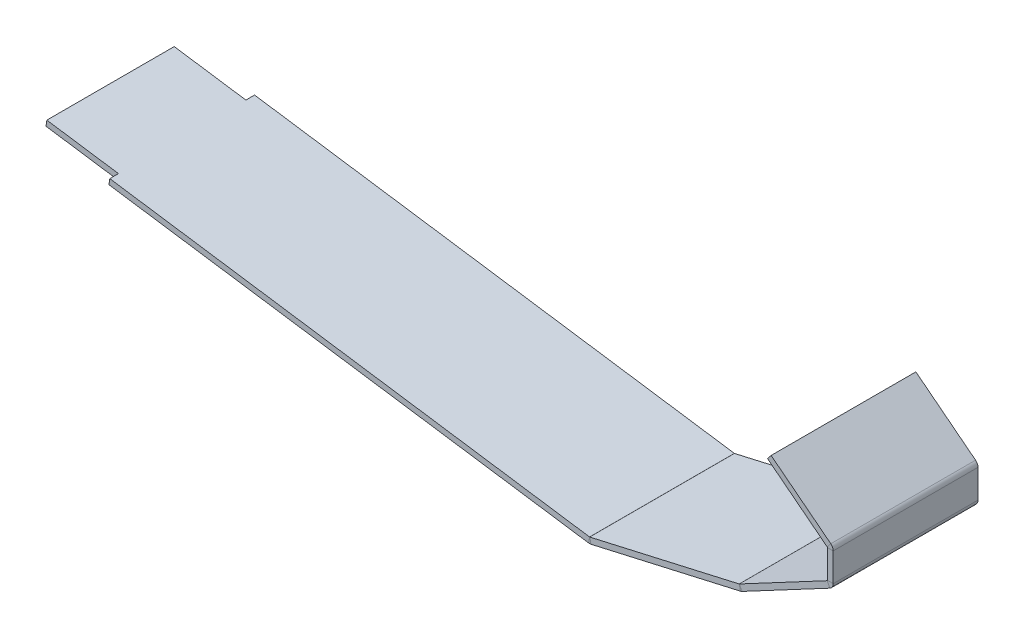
ISO-10303-21;
HEADER;
FILE_DESCRIPTION(('STEP AP214'),'2;1');
FILE_NAME('part.step','',(''),(''),'','','');
FILE_SCHEMA(('AUTOMOTIVE_DESIGN { 1 0 10303 214 1 1 1 1 }'));
ENDSEC;
DATA;
#1=APPLICATION_CONTEXT('core data for automotive mechanical design processes');
#2=APPLICATION_PROTOCOL_DEFINITION('international standard','automotive_design',2000,#1);
#3=PRODUCT_CONTEXT('',#1,'mechanical');
#4=PRODUCT('Part','Part','',(#3));
#5=PRODUCT_RELATED_PRODUCT_CATEGORY('part','',(#4));
#6=PRODUCT_DEFINITION_FORMATION('','',#4);
#7=PRODUCT_DEFINITION_CONTEXT('part definition',#1,'design');
#8=PRODUCT_DEFINITION('design','',#6,#7);
#9=PRODUCT_DEFINITION_SHAPE('','',#8);
#10=(LENGTH_UNIT() NAMED_UNIT(*) SI_UNIT(.MILLI.,.METRE.));
#11=(NAMED_UNIT(*) PLANE_ANGLE_UNIT() SI_UNIT($,.RADIAN.));
#12=(NAMED_UNIT(*) SI_UNIT($,.STERADIAN.) SOLID_ANGLE_UNIT());
#13=UNCERTAINTY_MEASURE_WITH_UNIT(LENGTH_MEASURE(1.E-05),#10,'distance_accuracy_value','');
#14=(GEOMETRIC_REPRESENTATION_CONTEXT(3) GLOBAL_UNCERTAINTY_ASSIGNED_CONTEXT((#13)) GLOBAL_UNIT_ASSIGNED_CONTEXT((#10,
#11,#12)) REPRESENTATION_CONTEXT('',''));
#15=CARTESIAN_POINT('',(0.,0.,0.));
#16=DIRECTION('',(0.,0.,1.));
#17=DIRECTION('',(1.,0.,0.));
#18=AXIS2_PLACEMENT_3D('',#15,#16,#17);
#19=CARTESIAN_POINT('',(-0.283103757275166,40.2211848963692,200.));
#20=DIRECTION('',(0.,0.,1.));
#21=DIRECTION('',(1.,0.,0.));
#22=AXIS2_PLACEMENT_3D('',#19,#20,#21);
#23=PLANE('',#22);
#24=DIRECTION('',(0.615661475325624,0.788010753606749,0.));
#25=VECTOR('',#24,1.);
#26=CARTESIAN_POINT('',(-0.283103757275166,40.2211848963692,200.));
#27=LINE('',#26,#25);
#28=CARTESIAN_POINT('',(-0.283103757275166,40.2211848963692,200.));
#29=VERTEX_POINT('',#28);
#30=CARTESIAN_POINT('',(4.64218804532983,46.5252709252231,200.));
#31=VERTEX_POINT('',#30);
#32=EDGE_CURVE('E257',#29,#31,#27,.T.);
#33=ORIENTED_EDGE('',*,*,#32,.F.);
#34=CARTESIAN_POINT('',(-0.736600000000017,39.6407361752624,200.));
#35=DIRECTION('',(0.,0.,1.));
#36=DIRECTION('',(1.,0.,0.));
#37=AXIS2_PLACEMENT_3D('',#34,#35,#36);
#38=CIRCLE('',#37,0.7366);
#39=CARTESIAN_POINT('',(0.,39.6407361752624,200.));
#40=VERTEX_POINT('',#39);
#41=EDGE_CURVE('E320',#29,#40,#38,.F.);
#42=ORIENTED_EDGE('',*,*,#41,.T.);
#43=DIRECTION('',(-1.,0.,0.));
#44=VECTOR('',#43,1.);
#45=CARTESIAN_POINT('',(8.,39.6407361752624,200.));
#46=LINE('',#45,#44);
#47=CARTESIAN_POINT('',(8.,39.6407361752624,200.));
#48=VERTEX_POINT('',#47);
#49=EDGE_CURVE('E255',#48,#40,#46,.T.);
#50=ORIENTED_EDGE('',*,*,#49,.F.);
#51=CARTESIAN_POINT('',(-0.736600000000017,39.6407361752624,200.));
#52=DIRECTION('',(0.,0.,1.));
#53=DIRECTION('',(1.,0.,0.));
#54=AXIS2_PLACEMENT_3D('',#51,#52,#53);
#55=CIRCLE('',#54,8.7366);
#56=EDGE_CURVE('E308',#31,#48,#55,.F.);
#57=ORIENTED_EDGE('',*,*,#56,.F.);
#58=EDGE_LOOP('',(#33,#42,#50,#57));
#59=FACE_BOUND('',#58,.T.);
#60=ADVANCED_FACE('F41',(#59),#23,.T.);
#61=CARTESIAN_POINT('',(8.,39.6407361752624,200.));
#62=DIRECTION('',(0.,0.,1.));
#63=DIRECTION('',(1.,0.,0.));
#64=AXIS2_PLACEMENT_3D('',#61,#62,#63);
#65=PLANE('',#64);
#66=DIRECTION('',(0.788010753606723,-0.615661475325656,0.));
#67=VECTOR('',#66,1.);
#68=CARTESIAN_POINT('',(-82.741129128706,104.644454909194,200.));
#69=LINE('',#68,#67);
#70=CARTESIAN_POINT('',(-82.741129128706,104.644454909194,200.));
#71=VERTEX_POINT('',#70);
#72=EDGE_CURVE('E317',#71,#29,#69,.T.);
#73=ORIENTED_EDGE('',*,*,#72,.T.);
#74=ORIENTED_EDGE('',*,*,#32,.T.);
#75=DIRECTION('',(0.788010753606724,-0.615661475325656,0.));
#76=VECTOR('',#75,1.);
#77=CARTESIAN_POINT('',(-77.8158373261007,110.948540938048,200.));
#78=LINE('',#77,#76);
#79=CARTESIAN_POINT('',(-77.8158373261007,110.948540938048,200.));
#80=VERTEX_POINT('',#79);
#81=EDGE_CURVE('E311',#80,#31,#78,.T.);
#82=ORIENTED_EDGE('',*,*,#81,.F.);
#83=DIRECTION('',(0.615661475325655,0.788010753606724,0.));
#84=VECTOR('',#83,1.);
#85=CARTESIAN_POINT('',(-82.741129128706,104.644454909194,200.));
#86=LINE('',#85,#84);
#87=EDGE_CURVE('E314',#71,#80,#86,.T.);
#88=ORIENTED_EDGE('',*,*,#87,.F.);
#89=EDGE_LOOP('',(#73,#74,#82,#88));
#90=FACE_BOUND('',#89,.T.);
#91=ADVANCED_FACE('F536',(#90),#65,.T.);
#92=CARTESIAN_POINT('',(0.,39.6407361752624,0.));
#93=DIRECTION('',(0.,0.,-1.));
#94=DIRECTION('',(-1.,0.,0.));
#95=AXIS2_PLACEMENT_3D('',#92,#93,#94);
#96=PLANE('',#95);
#97=DIRECTION('',(1.,0.,0.));
#98=VECTOR('',#97,1.);
#99=CARTESIAN_POINT('',(0.,39.6407361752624,0.));
#100=LINE('',#99,#98);
#101=CARTESIAN_POINT('',(0.,39.6407361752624,0.));
#102=VERTEX_POINT('',#101);
#103=CARTESIAN_POINT('',(8.,39.6407361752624,0.));
#104=VERTEX_POINT('',#103);
#105=EDGE_CURVE('E253',#102,#104,#100,.T.);
#106=ORIENTED_EDGE('',*,*,#105,.F.);
#107=CARTESIAN_POINT('',(-0.736600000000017,39.6407361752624,0.));
#108=DIRECTION('',(0.,0.,1.));
#109=DIRECTION('',(1.,0.,0.));
#110=AXIS2_PLACEMENT_3D('',#107,#108,#109);
#111=CIRCLE('',#110,0.7366);
#112=CARTESIAN_POINT('',(-0.283103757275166,40.2211848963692,0.));
#113=VERTEX_POINT('',#112);
#114=EDGE_CURVE('E374',#113,#102,#111,.F.);
#115=ORIENTED_EDGE('',*,*,#114,.F.);
#116=DIRECTION('',(-0.615661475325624,-0.788010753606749,0.));
#117=VECTOR('',#116,1.);
#118=CARTESIAN_POINT('',(4.64218804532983,46.5252709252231,0.));
#119=LINE('',#118,#117);
#120=CARTESIAN_POINT('',(4.64218804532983,46.5252709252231,0.));
#121=VERTEX_POINT('',#120);
#122=EDGE_CURVE('E251',#121,#113,#119,.T.);
#123=ORIENTED_EDGE('',*,*,#122,.F.);
#124=CARTESIAN_POINT('',(-0.736600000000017,39.6407361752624,0.));
#125=DIRECTION('',(0.,0.,1.));
#126=DIRECTION('',(1.,0.,0.));
#127=AXIS2_PLACEMENT_3D('',#124,#125,#126);
#128=CIRCLE('',#127,8.7366);
#129=EDGE_CURVE('E362',#121,#104,#128,.F.);
#130=ORIENTED_EDGE('',*,*,#129,.T.);
#131=EDGE_LOOP('',(#106,#115,#123,#130));
#132=FACE_BOUND('',#131,.T.);
#133=ADVANCED_FACE('F569',(#132),#96,.T.);
#134=CARTESIAN_POINT('',(4.64218804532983,46.5252709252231,0.));
#135=DIRECTION('',(0.,0.,-1.));
#136=DIRECTION('',(-1.,0.,0.));
#137=AXIS2_PLACEMENT_3D('',#134,#135,#136);
#138=PLANE('',#137);
#139=DIRECTION('',(0.,-1.,0.));
#140=VECTOR('',#139,1.);
#141=CARTESIAN_POINT('',(0.,40.,0.));
#142=LINE('',#141,#140);
#143=CARTESIAN_POINT('',(0.,0.442418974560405,0.));
#144=VERTEX_POINT('',#143);
#145=EDGE_CURVE('E377',#102,#144,#142,.T.);
#146=ORIENTED_EDGE('',*,*,#145,.F.);
#147=ORIENTED_EDGE('',*,*,#105,.T.);
#148=DIRECTION('',(0.,-1.,0.));
#149=VECTOR('',#148,1.);
#150=CARTESIAN_POINT('',(8.,40.,0.));
#151=LINE('',#150,#149);
#152=CARTESIAN_POINT('',(8.,0.442418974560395,0.));
#153=VERTEX_POINT('',#152);
#154=EDGE_CURVE('E359',#104,#153,#151,.T.);
#155=ORIENTED_EDGE('',*,*,#154,.T.);
#156=DIRECTION('',(-1.,0.,0.));
#157=VECTOR('',#156,1.);
#158=CARTESIAN_POINT('',(8.,0.442418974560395,0.));
#159=LINE('',#158,#157);
#160=EDGE_CURVE('E243',#153,#144,#159,.T.);
#161=ORIENTED_EDGE('',*,*,#160,.T.);
#162=EDGE_LOOP('',(#146,#147,#155,#161));
#163=FACE_BOUND('',#162,.T.);
#164=ADVANCED_FACE('F567',(#163),#138,.T.);
#165=CARTESIAN_POINT('',(0.,0.442418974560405,200.));
#166=DIRECTION('',(0.,0.,1.));
#167=DIRECTION('',(1.,0.,0.));
#168=AXIS2_PLACEMENT_3D('',#165,#166,#167);
#169=PLANE('',#168);
#170=DIRECTION('',(1.,0.,0.));
#171=VECTOR('',#170,1.);
#172=CARTESIAN_POINT('',(0.,0.442418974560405,200.));
#173=LINE('',#172,#171);
#174=CARTESIAN_POINT('',(0.,0.442418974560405,200.));
#175=VERTEX_POINT('',#174);
#176=CARTESIAN_POINT('',(8.,0.442418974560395,200.));
#177=VERTEX_POINT('',#176);
#178=EDGE_CURVE('E249',#175,#177,#173,.T.);
#179=ORIENTED_EDGE('',*,*,#178,.F.);
#180=CARTESIAN_POINT('',(-0.7366,0.442418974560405,200.));
#181=DIRECTION('',(0.,0.,1.));
#182=DIRECTION('',(1.,0.,0.));
#183=AXIS2_PLACEMENT_3D('',#180,#181,#182);
#184=CIRCLE('',#183,0.7366);
#185=CARTESIAN_POINT('',(-0.390560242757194,-0.20783947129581,200.));
#186=VERTEX_POINT('',#185);
#187=EDGE_CURVE('E326',#175,#186,#184,.F.);
#188=ORIENTED_EDGE('',*,*,#187,.T.);
#189=DIRECTION('',(-0.469779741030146,0.882783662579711,0.));
#190=VECTOR('',#189,1.);
#191=CARTESIAN_POINT('',(3.36767768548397,-7.2701087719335,200.));
#192=LINE('',#191,#190);
#193=CARTESIAN_POINT('',(3.36767768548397,-7.2701087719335,200.));
#194=VERTEX_POINT('',#193);
#195=EDGE_CURVE('E247',#194,#186,#192,.T.);
#196=ORIENTED_EDGE('',*,*,#195,.F.);
#197=CARTESIAN_POINT('',(-0.7366,0.442418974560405,200.));
#198=DIRECTION('',(0.,0.,1.));
#199=DIRECTION('',(1.,0.,0.));
#200=AXIS2_PLACEMENT_3D('',#197,#198,#199);
#201=CIRCLE('',#200,8.7366);
#202=EDGE_CURVE('E302',#177,#194,#201,.F.);
#203=ORIENTED_EDGE('',*,*,#202,.F.);
#204=EDGE_LOOP('',(#179,#188,#196,#203));
#205=FACE_BOUND('',#204,.T.);
#206=ADVANCED_FACE('F516',(#205),#169,.T.);
#207=CARTESIAN_POINT('',(3.36767768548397,-7.2701087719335,200.));
#208=DIRECTION('',(0.,0.,1.));
#209=DIRECTION('',(1.,0.,0.));
#210=AXIS2_PLACEMENT_3D('',#207,#208,#209);
#211=PLANE('',#210);
#212=DIRECTION('',(0.,-1.,0.));
#213=VECTOR('',#212,1.);
#214=CARTESIAN_POINT('',(0.,40.,200.));
#215=LINE('',#214,#213);
#216=EDGE_CURVE('E323',#40,#175,#215,.T.);
#217=ORIENTED_EDGE('',*,*,#216,.T.);
#218=ORIENTED_EDGE('',*,*,#178,.T.);
#219=DIRECTION('',(0.,-1.,0.));
#220=VECTOR('',#219,1.);
#221=CARTESIAN_POINT('',(8.,40.,200.));
#222=LINE('',#221,#220);
#223=EDGE_CURVE('E305',#48,#177,#222,.T.);
#224=ORIENTED_EDGE('',*,*,#223,.F.);
#225=ORIENTED_EDGE('',*,*,#49,.T.);
#226=EDGE_LOOP('',(#217,#218,#224,#225));
#227=FACE_BOUND('',#226,.T.);
#228=ADVANCED_FACE('F523',(#227),#211,.T.);
#229=CARTESIAN_POINT('',(-0.390560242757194,-0.20783947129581,0.));
#230=DIRECTION('',(0.,0.,-1.));
#231=DIRECTION('',(-1.,0.,0.));
#232=AXIS2_PLACEMENT_3D('',#229,#230,#231);
#233=PLANE('',#232);
#234=DIRECTION('',(0.469779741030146,-0.882783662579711,0.));
#235=VECTOR('',#234,1.);
#236=CARTESIAN_POINT('',(-0.390560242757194,-0.20783947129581,0.));
#237=LINE('',#236,#235);
#238=CARTESIAN_POINT('',(-0.390560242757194,-0.20783947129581,0.));
#239=VERTEX_POINT('',#238);
#240=CARTESIAN_POINT('',(3.36767768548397,-7.2701087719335,0.));
#241=VERTEX_POINT('',#240);
#242=EDGE_CURVE('E245',#239,#241,#237,.T.);
#243=ORIENTED_EDGE('',*,*,#242,.F.);
#244=CARTESIAN_POINT('',(-0.7366,0.442418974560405,0.));
#245=DIRECTION('',(0.,0.,1.));
#246=DIRECTION('',(1.,0.,0.));
#247=AXIS2_PLACEMENT_3D('',#244,#245,#246);
#248=CIRCLE('',#247,0.7366);
#249=EDGE_CURVE('E380',#144,#239,#248,.F.);
#250=ORIENTED_EDGE('',*,*,#249,.F.);
#251=ORIENTED_EDGE('',*,*,#160,.F.);
#252=CARTESIAN_POINT('',(-0.7366,0.442418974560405,0.));
#253=DIRECTION('',(0.,0.,1.));
#254=DIRECTION('',(1.,0.,0.));
#255=AXIS2_PLACEMENT_3D('',#252,#253,#254);
#256=CIRCLE('',#255,8.7366);
#257=EDGE_CURVE('E356',#153,#241,#256,.F.);
#258=ORIENTED_EDGE('',*,*,#257,.T.);
#259=EDGE_LOOP('',(#243,#250,#251,#258));
#260=FACE_BOUND('',#259,.T.);
#261=ADVANCED_FACE('F565',(#260),#233,.T.);
#262=CARTESIAN_POINT('',(8.,0.442418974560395,0.));
#263=DIRECTION('',(0.,0.,-1.));
#264=DIRECTION('',(-1.,0.,0.));
#265=AXIS2_PLACEMENT_3D('',#262,#263,#264);
#266=PLANE('',#265);
#267=DIRECTION('',(-0.882783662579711,-0.469779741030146,0.));
#268=VECTOR('',#267,1.);
#269=CARTESIAN_POINT('',(0.,0.,0.));
#270=LINE('',#269,#268);
#271=CARTESIAN_POINT('',(-121.737555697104,-64.7835249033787,0.));
#272=VERTEX_POINT('',#271);
#273=EDGE_CURVE('E383',#239,#272,#270,.T.);
#274=ORIENTED_EDGE('',*,*,#273,.F.);
#275=ORIENTED_EDGE('',*,*,#242,.T.);
#276=DIRECTION('',(-0.882783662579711,-0.469779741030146,0.));
#277=VECTOR('',#276,1.);
#278=CARTESIAN_POINT('',(3.75823792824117,-7.06226930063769,0.));
#279=LINE('',#278,#277);
#280=CARTESIAN_POINT('',(-117.979317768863,-71.8457942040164,0.));
#281=VERTEX_POINT('',#280);
#282=EDGE_CURVE('E353',#241,#281,#279,.T.);
#283=ORIENTED_EDGE('',*,*,#282,.T.);
#284=DIRECTION('',(-0.469779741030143,0.882783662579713,0.));
#285=VECTOR('',#284,1.);
#286=CARTESIAN_POINT('',(-117.979317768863,-71.8457942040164,0.));
#287=LINE('',#286,#285);
#288=EDGE_CURVE('E235',#281,#272,#287,.T.);
#289=ORIENTED_EDGE('',*,*,#288,.T.);
#290=EDGE_LOOP('',(#274,#275,#283,#289));
#291=FACE_BOUND('',#290,.T.);
#292=ADVANCED_FACE('F563',(#291),#266,.T.);
#293=CARTESIAN_POINT('',(-121.737555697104,-64.7835249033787,200.));
#294=DIRECTION('',(0.,0.,1.));
#295=DIRECTION('',(1.,0.,0.));
#296=AXIS2_PLACEMENT_3D('',#293,#294,#295);
#297=PLANE('',#296);
#298=DIRECTION('',(0.469779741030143,-0.882783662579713,0.));
#299=VECTOR('',#298,1.);
#300=CARTESIAN_POINT('',(-121.737555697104,-64.7835249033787,200.));
#301=LINE('',#300,#299);
#302=CARTESIAN_POINT('',(-121.737555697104,-64.7835249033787,200.));
#303=VERTEX_POINT('',#302);
#304=CARTESIAN_POINT('',(-117.979317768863,-71.8457942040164,200.));
#305=VERTEX_POINT('',#304);
#306=EDGE_CURVE('E241',#303,#305,#301,.T.);
#307=ORIENTED_EDGE('',*,*,#306,.F.);
#308=CARTESIAN_POINT('',(-122.083595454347,-64.1332664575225,200.));
#309=DIRECTION('',(0.,0.,1.));
#310=DIRECTION('',(1.,0.,0.));
#311=AXIS2_PLACEMENT_3D('',#308,#309,#310);
#312=CIRCLE('',#311,0.7366);
#313=CARTESIAN_POINT('',(-121.919776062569,-64.851418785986,200.));
#314=VERTEX_POINT('',#313);
#315=EDGE_CURVE('E332',#303,#314,#312,.F.);
#316=ORIENTED_EDGE('',*,*,#315,.T.);
#317=DIRECTION('',(-0.222399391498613,0.974955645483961,0.));
#318=VECTOR('',#317,1.);
#319=CARTESIAN_POINT('',(-120.14058093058,-72.6510639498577,200.));
#320=LINE('',#319,#318);
#321=CARTESIAN_POINT('',(-120.14058093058,-72.6510639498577,200.));
#322=VERTEX_POINT('',#321);
#323=EDGE_CURVE('E239',#322,#314,#320,.T.);
#324=ORIENTED_EDGE('',*,*,#323,.F.);
#325=CARTESIAN_POINT('',(-122.083595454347,-64.1332664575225,200.));
#326=DIRECTION('',(0.,0.,1.));
#327=DIRECTION('',(1.,0.,0.));
#328=AXIS2_PLACEMENT_3D('',#325,#326,#327);
#329=CIRCLE('',#328,8.7366);
#330=EDGE_CURVE('E296',#305,#322,#329,.F.);
#331=ORIENTED_EDGE('',*,*,#330,.F.);
#332=EDGE_LOOP('',(#307,#316,#324,#331));
#333=FACE_BOUND('',#332,.T.);
#334=ADVANCED_FACE('F496',(#333),#297,.T.);
#335=CARTESIAN_POINT('',(-120.14058093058,-72.6510639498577,200.));
#336=DIRECTION('',(0.,0.,1.));
#337=DIRECTION('',(1.,0.,0.));
#338=AXIS2_PLACEMENT_3D('',#335,#336,#337);
#339=PLANE('',#338);
#340=DIRECTION('',(-0.882783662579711,-0.469779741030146,0.));
#341=VECTOR('',#340,1.);
#342=CARTESIAN_POINT('',(0.,0.,200.));
#343=LINE('',#342,#341);
#344=EDGE_CURVE('E329',#186,#303,#343,.T.);
#345=ORIENTED_EDGE('',*,*,#344,.T.);
#346=ORIENTED_EDGE('',*,*,#306,.T.);
#347=DIRECTION('',(-0.882783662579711,-0.469779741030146,0.));
#348=VECTOR('',#347,1.);
#349=CARTESIAN_POINT('',(3.75823792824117,-7.06226930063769,200.));
#350=LINE('',#349,#348);
#351=EDGE_CURVE('E299',#194,#305,#350,.T.);
#352=ORIENTED_EDGE('',*,*,#351,.F.);
#353=ORIENTED_EDGE('',*,*,#195,.T.);
#354=EDGE_LOOP('',(#345,#346,#352,#353));
#355=FACE_BOUND('',#354,.T.);
#356=ADVANCED_FACE('F509',(#355),#339,.T.);
#357=CARTESIAN_POINT('',(-121.919776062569,-64.851418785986,0.));
#358=DIRECTION('',(0.,0.,-1.));
#359=DIRECTION('',(-1.,0.,0.));
#360=AXIS2_PLACEMENT_3D('',#357,#358,#359);
#361=PLANE('',#360);
#362=DIRECTION('',(0.222399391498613,-0.974955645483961,0.));
#363=VECTOR('',#362,1.);
#364=CARTESIAN_POINT('',(-121.919776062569,-64.851418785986,0.));
#365=LINE('',#364,#363);
#366=CARTESIAN_POINT('',(-121.919776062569,-64.851418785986,0.));
#367=VERTEX_POINT('',#366);
#368=CARTESIAN_POINT('',(-120.14058093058,-72.6510639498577,0.));
#369=VERTEX_POINT('',#368);
#370=EDGE_CURVE('E237',#367,#369,#365,.T.);
#371=ORIENTED_EDGE('',*,*,#370,.F.);
#372=CARTESIAN_POINT('',(-122.083595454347,-64.1332664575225,0.));
#373=DIRECTION('',(0.,0.,1.));
#374=DIRECTION('',(1.,0.,0.));
#375=AXIS2_PLACEMENT_3D('',#372,#373,#374);
#376=CIRCLE('',#375,0.7366);
#377=EDGE_CURVE('E386',#272,#367,#376,.F.);
#378=ORIENTED_EDGE('',*,*,#377,.F.);
#379=ORIENTED_EDGE('',*,*,#288,.F.);
#380=CARTESIAN_POINT('',(-122.083595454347,-64.1332664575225,0.));
#381=DIRECTION('',(0.,0.,1.));
#382=DIRECTION('',(1.,0.,0.));
#383=AXIS2_PLACEMENT_3D('',#380,#381,#382);
#384=CIRCLE('',#383,8.7366);
#385=EDGE_CURVE('E350',#281,#369,#384,.F.);
#386=ORIENTED_EDGE('',*,*,#385,.T.);
#387=EDGE_LOOP('',(#371,#378,#379,#386));
#388=FACE_BOUND('',#387,.T.);
#389=ADVANCED_FACE('F500',(#388),#361,.T.);
#390=CARTESIAN_POINT('',(-117.979317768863,-71.8457942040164,0.));
#391=DIRECTION('',(0.,0.,-1.));
#392=DIRECTION('',(-1.,0.,0.));
#393=AXIS2_PLACEMENT_3D('',#390,#391,#392);
#394=PLANE('',#393);
#395=DIRECTION('',(-0.974955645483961,-0.222399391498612,0.));
#396=VECTOR('',#395,1.);
#397=CARTESIAN_POINT('',(-121.824145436,-64.8296042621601,0.));
#398=LINE('',#397,#396);
#399=CARTESIAN_POINT('',(-328.380343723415,-111.947617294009,0.));
#400=VERTEX_POINT('',#399);
#401=EDGE_CURVE('E389',#367,#400,#398,.T.);
#402=ORIENTED_EDGE('',*,*,#401,.F.);
#403=ORIENTED_EDGE('',*,*,#370,.T.);
#404=DIRECTION('',(-0.974955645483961,-0.222399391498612,0.));
#405=VECTOR('',#404,1.);
#406=CARTESIAN_POINT('',(-120.044950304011,-72.6292494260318,0.));
#407=LINE('',#406,#405);
#408=CARTESIAN_POINT('',(-326.601148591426,-119.747262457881,0.));
#409=VERTEX_POINT('',#408);
#410=EDGE_CURVE('E347',#369,#409,#407,.T.);
#411=ORIENTED_EDGE('',*,*,#410,.T.);
#412=DIRECTION('',(-0.222399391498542,0.974955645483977,0.));
#413=VECTOR('',#412,1.);
#414=CARTESIAN_POINT('',(-326.601148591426,-119.747262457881,0.));
#415=LINE('',#414,#413);
#416=EDGE_CURVE('E221',#409,#400,#415,.T.);
#417=ORIENTED_EDGE('',*,*,#416,.T.);
#418=EDGE_LOOP('',(#402,#403,#411,#417));
#419=FACE_BOUND('',#418,.T.);
#420=ADVANCED_FACE('F484',(#419),#394,.T.);
#421=CARTESIAN_POINT('',(-328.380343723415,-111.947617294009,200.));
#422=DIRECTION('',(0.,0.,1.));
#423=DIRECTION('',(1.,0.,0.));
#424=AXIS2_PLACEMENT_3D('',#421,#422,#423);
#425=PLANE('',#424);
#426=DIRECTION('',(0.222399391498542,-0.974955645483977,0.));
#427=VECTOR('',#426,1.);
#428=CARTESIAN_POINT('',(-328.380343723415,-111.947617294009,200.));
#429=LINE('',#428,#427);
#430=CARTESIAN_POINT('',(-328.380343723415,-111.947617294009,200.));
#431=VERTEX_POINT('',#430);
#432=CARTESIAN_POINT('',(-326.601148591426,-119.747262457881,200.));
#433=VERTEX_POINT('',#432);
#434=EDGE_CURVE('E233',#431,#433,#429,.T.);
#435=ORIENTED_EDGE('',*,*,#434,.F.);
#436=CARTESIAN_POINT('',(-328.544163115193,-111.229464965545,200.));
#437=DIRECTION('',(0.,0.,1.));
#438=DIRECTION('',(1.,0.,0.));
#439=AXIS2_PLACEMENT_3D('',#436,#437,#438);
#440=CIRCLE('',#439,0.7366);
#441=CARTESIAN_POINT('',(-328.651131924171,-111.958256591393,200.));
#442=VERTEX_POINT('',#441);
#443=EDGE_CURVE('E338',#431,#442,#440,.F.);
#444=ORIENTED_EDGE('',*,*,#443,.T.);
#445=DIRECTION('',(0.145219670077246,0.989399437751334,0.));
#446=VECTOR('',#445,1.);
#447=CARTESIAN_POINT('',(-329.812889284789,-119.873452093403,200.));
#448=LINE('',#447,#446);
#449=CARTESIAN_POINT('',(-329.812889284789,-119.873452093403,200.));
#450=VERTEX_POINT('',#449);
#451=EDGE_CURVE('E231',#450,#442,#448,.T.);
#452=ORIENTED_EDGE('',*,*,#451,.F.);
#453=CARTESIAN_POINT('',(-328.544163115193,-111.229464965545,200.));
#454=DIRECTION('',(0.,0.,1.));
#455=DIRECTION('',(1.,0.,0.));
#456=AXIS2_PLACEMENT_3D('',#453,#454,#455);
#457=CIRCLE('',#456,8.7366);
#458=EDGE_CURVE('E290',#433,#450,#457,.F.);
#459=ORIENTED_EDGE('',*,*,#458,.F.);
#460=EDGE_LOOP('',(#435,#444,#452,#459));
#461=FACE_BOUND('',#460,.T.);
#462=ADVANCED_FACE('F461',(#461),#425,.T.);
#463=CARTESIAN_POINT('',(-329.812889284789,-119.873452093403,200.));
#464=DIRECTION('',(0.,0.,1.));
#465=DIRECTION('',(1.,0.,0.));
#466=AXIS2_PLACEMENT_3D('',#463,#464,#465);
#467=PLANE('',#466);
#468=DIRECTION('',(-0.974955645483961,-0.222399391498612,0.));
#469=VECTOR('',#468,1.);
#470=CARTESIAN_POINT('',(-121.824145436,-64.8296042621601,200.));
#471=LINE('',#470,#469);
#472=EDGE_CURVE('E335',#314,#431,#471,.T.);
#473=ORIENTED_EDGE('',*,*,#472,.T.);
#474=ORIENTED_EDGE('',*,*,#434,.T.);
#475=DIRECTION('',(-0.974955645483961,-0.222399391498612,0.));
#476=VECTOR('',#475,1.);
#477=CARTESIAN_POINT('',(-120.044950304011,-72.6292494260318,200.));
#478=LINE('',#477,#476);
#479=EDGE_CURVE('E293',#322,#433,#478,.T.);
#480=ORIENTED_EDGE('',*,*,#479,.F.);
#481=ORIENTED_EDGE('',*,*,#323,.T.);
#482=EDGE_LOOP('',(#473,#474,#480,#481));
#483=FACE_BOUND('',#482,.T.);
#484=ADVANCED_FACE('F493',(#483),#467,.T.);
#485=CARTESIAN_POINT('',(-328.651131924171,-111.958256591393,0.));
#486=DIRECTION('',(0.,0.,-1.));
#487=DIRECTION('',(-1.,0.,0.));
#488=AXIS2_PLACEMENT_3D('',#485,#486,#487);
#489=PLANE('',#488);
#490=DIRECTION('',(-0.145219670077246,-0.989399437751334,0.));
#491=VECTOR('',#490,1.);
#492=CARTESIAN_POINT('',(-328.651131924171,-111.958256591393,0.));
#493=LINE('',#492,#491);
#494=CARTESIAN_POINT('',(-328.651131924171,-111.958256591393,0.));
#495=VERTEX_POINT('',#494);
#496=CARTESIAN_POINT('',(-329.812889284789,-119.873452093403,0.));
#497=VERTEX_POINT('',#496);
#498=EDGE_CURVE('E224',#495,#497,#493,.T.);
#499=ORIENTED_EDGE('',*,*,#498,.F.);
#500=CARTESIAN_POINT('',(-328.544163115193,-111.229464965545,0.));
#501=DIRECTION('',(0.,0.,1.));
#502=DIRECTION('',(1.,0.,0.));
#503=AXIS2_PLACEMENT_3D('',#500,#501,#502);
#504=CIRCLE('',#503,0.7366);
#505=EDGE_CURVE('E288',#400,#495,#504,.F.);
#506=ORIENTED_EDGE('',*,*,#505,.F.);
#507=ORIENTED_EDGE('',*,*,#416,.F.);
#508=CARTESIAN_POINT('',(-328.544163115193,-111.229464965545,0.));
#509=DIRECTION('',(0.,0.,1.));
#510=DIRECTION('',(1.,0.,0.));
#511=AXIS2_PLACEMENT_3D('',#508,#509,#510);
#512=CIRCLE('',#511,8.7366);
#513=EDGE_CURVE('E344',#409,#497,#512,.F.);
#514=ORIENTED_EDGE('',*,*,#513,.T.);
#515=EDGE_LOOP('',(#499,#506,#507,#514));
#516=FACE_BOUND('',#515,.T.);
#517=ADVANCED_FACE('F451',(#516),#489,.T.);
#518=CARTESIAN_POINT('',(-326.601148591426,-119.747262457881,0.));
#519=DIRECTION('',(0.,0.,-1.));
#520=DIRECTION('',(-1.,0.,0.));
#521=AXIS2_PLACEMENT_3D('',#518,#519,#520);
#522=PLANE('',#521);
#523=DIRECTION('',(0.145219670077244,0.989399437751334,0.));
#524=VECTOR('',#523,1.);
#525=CARTESIAN_POINT('',(-992.864562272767,-24.5750906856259,0.));
#526=LINE('',#525,#524);
#527=CARTESIAN_POINT('',(-992.574122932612,-22.5962918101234,0.));
#528=VERTEX_POINT('',#527);
#529=CARTESIAN_POINT('',(-991.412365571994,-14.6810963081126,0.));
#530=VERTEX_POINT('',#529);
#531=EDGE_CURVE('E467',#528,#530,#526,.T.);
#532=ORIENTED_EDGE('',*,*,#531,.T.);
#533=DIRECTION('',(-0.989399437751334,0.145219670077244,0.));
#534=VECTOR('',#533,1.);
#535=CARTESIAN_POINT('',(-328.5147422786,-111.978275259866,0.));
#536=LINE('',#535,#534);
#537=EDGE_CURVE('E279',#495,#530,#536,.T.);
#538=ORIENTED_EDGE('',*,*,#537,.F.);
#539=ORIENTED_EDGE('',*,*,#498,.T.);
#540=DIRECTION('',(-0.989399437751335,0.145219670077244,0.));
#541=VECTOR('',#540,1.);
#542=CARTESIAN_POINT('',(-329.676499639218,-119.893470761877,0.));
#543=LINE('',#542,#541);
#544=EDGE_CURVE('E281',#497,#528,#543,.T.);
#545=ORIENTED_EDGE('',*,*,#544,.T.);
#546=EDGE_LOOP('',(#532,#538,#539,#545));
#547=FACE_BOUND('',#546,.T.);
#548=ADVANCED_FACE('F476',(#547),#522,.T.);
#549=CARTESIAN_POINT('',(-328.5147422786,-111.978275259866,200.));
#550=DIRECTION('',(-0.145219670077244,-0.989399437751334,0.));
#551=DIRECTION('',(0.989399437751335,-0.145219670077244,0.));
#552=AXIS2_PLACEMENT_3D('',#549,#550,#551);
#553=PLANE('',#552);
#554=ORIENTED_EDGE('',*,*,#537,.T.);
#555=DIRECTION('',(0.,0.,-1.));
#556=VECTOR('',#555,1.);
#557=CARTESIAN_POINT('',(-991.412365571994,-14.6810963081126,0.));
#558=LINE('',#557,#556);
#559=CARTESIAN_POINT('',(-991.412365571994,-14.6810963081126,12.));
#560=VERTEX_POINT('',#559);
#561=EDGE_CURVE('E209',#560,#530,#558,.T.);
#562=ORIENTED_EDGE('',*,*,#561,.F.);
#563=DIRECTION('',(0.989399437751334,-0.145219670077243,0.));
#564=VECTOR('',#563,1.);
#565=CARTESIAN_POINT('',(-1090.35230934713,-0.159129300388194,12.));
#566=LINE('',#565,#564);
#567=CARTESIAN_POINT('',(-1090.35230934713,-0.159129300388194,12.));
#568=VERTEX_POINT('',#567);
#569=EDGE_CURVE('E202',#568,#560,#566,.T.);
#570=ORIENTED_EDGE('',*,*,#569,.F.);
#571=DIRECTION('',(0.,0.,-1.));
#572=VECTOR('',#571,1.);
#573=CARTESIAN_POINT('',(-1090.35230934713,-0.159129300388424,200.));
#574=LINE('',#573,#572);
#575=CARTESIAN_POINT('',(-1090.35230934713,-0.159129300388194,188.));
#576=VERTEX_POINT('',#575);
#577=EDGE_CURVE('E216',#576,#568,#574,.T.);
#578=ORIENTED_EDGE('',*,*,#577,.F.);
#579=DIRECTION('',(-0.989399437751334,0.145219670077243,0.));
#580=VECTOR('',#579,1.);
#581=CARTESIAN_POINT('',(-1090.35230934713,-0.159129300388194,188.));
#582=LINE('',#581,#580);
#583=CARTESIAN_POINT('',(-991.412365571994,-14.6810963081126,188.));
#584=VERTEX_POINT('',#583);
#585=EDGE_CURVE('E271',#584,#576,#582,.T.);
#586=ORIENTED_EDGE('',*,*,#585,.F.);
#587=DIRECTION('',(0.,0.,-1.));
#588=VECTOR('',#587,1.);
#589=CARTESIAN_POINT('',(-991.412365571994,-14.6810963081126,200.));
#590=LINE('',#589,#588);
#591=CARTESIAN_POINT('',(-991.412365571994,-14.6810963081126,200.));
#592=VERTEX_POINT('',#591);
#593=EDGE_CURVE('E270',#592,#584,#590,.T.);
#594=ORIENTED_EDGE('',*,*,#593,.F.);
#595=DIRECTION('',(-0.989399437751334,0.145219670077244,0.));
#596=VECTOR('',#595,1.);
#597=CARTESIAN_POINT('',(-328.5147422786,-111.978275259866,200.));
#598=LINE('',#597,#596);
#599=EDGE_CURVE('E285',#442,#592,#598,.T.);
#600=ORIENTED_EDGE('',*,*,#599,.F.);
#601=DIRECTION('',(0.,0.,-1.));
#602=VECTOR('',#601,1.);
#603=CARTESIAN_POINT('',(-328.651131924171,-111.958256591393,200.));
#604=LINE('',#603,#602);
#605=EDGE_CURVE('E340',#442,#495,#604,.T.);
#606=ORIENTED_EDGE('',*,*,#605,.T.);
#607=EDGE_LOOP('',(#554,#562,#570,#578,#586,#594,#600,#606));
#608=FACE_BOUND('',#607,.T.);
#609=ADVANCED_FACE('F214',(#608),#553,.F.);
#610=CARTESIAN_POINT('',(-1091.51406670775,-8.07432480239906,200.));
#611=DIRECTION('',(-0.98939943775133,0.145219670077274,0.));
#612=DIRECTION('',(-0.145219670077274,-0.98939943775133,0.));
#613=AXIS2_PLACEMENT_3D('',#610,#611,#612);
#614=PLANE('',#613);
#615=DIRECTION('',(0.145219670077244,0.989399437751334,0.));
#616=VECTOR('',#615,1.);
#617=CARTESIAN_POINT('',(-1091.8045060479,-10.0531236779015,12.));
#618=LINE('',#617,#616);
#619=CARTESIAN_POINT('',(-1091.51406670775,-8.07432480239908,12.));
#620=VERTEX_POINT('',#619);
#621=EDGE_CURVE('E199',#620,#568,#618,.T.);
#622=ORIENTED_EDGE('',*,*,#621,.F.);
#623=DIRECTION('',(0.,0.,-1.));
#624=VECTOR('',#623,1.);
#625=CARTESIAN_POINT('',(-1091.51406670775,-8.07432480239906,200.));
#626=LINE('',#625,#624);
#627=CARTESIAN_POINT('',(-1091.51406670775,-8.07432480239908,188.));
#628=VERTEX_POINT('',#627);
#629=EDGE_CURVE('E222',#628,#620,#626,.T.);
#630=ORIENTED_EDGE('',*,*,#629,.F.);
#631=DIRECTION('',(0.145219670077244,0.989399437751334,0.));
#632=VECTOR('',#631,1.);
#633=CARTESIAN_POINT('',(-1091.8045060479,-10.0531236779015,188.));
#634=LINE('',#633,#632);
#635=EDGE_CURVE('E220',#628,#576,#634,.T.);
#636=ORIENTED_EDGE('',*,*,#635,.T.);
#637=ORIENTED_EDGE('',*,*,#577,.T.);
#638=EDGE_LOOP('',(#622,#630,#636,#637));
#639=FACE_BOUND('',#638,.T.);
#640=ADVANCED_FACE('F219',(#639),#614,.T.);
#641=CARTESIAN_POINT('',(-329.676499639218,-119.893470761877,200.));
#642=DIRECTION('',(-0.145219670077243,-0.989399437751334,0.));
#643=DIRECTION('',(0.989399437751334,-0.145219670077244,0.));
#644=AXIS2_PLACEMENT_3D('',#641,#642,#643);
#645=PLANE('',#644);
#646=DIRECTION('',(0.,0.,1.));
#647=VECTOR('',#646,1.);
#648=CARTESIAN_POINT('',(-992.574122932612,-22.5962918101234,200.));
#649=LINE('',#648,#647);
#650=CARTESIAN_POINT('',(-992.574122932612,-22.5962918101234,12.));
#651=VERTEX_POINT('',#650);
#652=EDGE_CURVE('E11',#528,#651,#649,.T.);
#653=ORIENTED_EDGE('',*,*,#652,.F.);
#654=ORIENTED_EDGE('',*,*,#544,.F.);
#655=DIRECTION('',(0.,0.,-1.));
#656=VECTOR('',#655,1.);
#657=CARTESIAN_POINT('',(-329.812889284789,-119.873452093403,200.));
#658=LINE('',#657,#656);
#659=EDGE_CURVE('E226',#450,#497,#658,.T.);
#660=ORIENTED_EDGE('',*,*,#659,.F.);
#661=DIRECTION('',(-0.989399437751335,0.145219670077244,0.));
#662=VECTOR('',#661,1.);
#663=CARTESIAN_POINT('',(-329.676499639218,-119.893470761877,200.));
#664=LINE('',#663,#662);
#665=CARTESIAN_POINT('',(-992.574122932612,-22.5962918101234,200.));
#666=VERTEX_POINT('',#665);
#667=EDGE_CURVE('E278',#450,#666,#664,.T.);
#668=ORIENTED_EDGE('',*,*,#667,.T.);
#669=DIRECTION('',(0.,0.,1.));
#670=VECTOR('',#669,1.);
#671=CARTESIAN_POINT('',(-992.574122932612,-22.5962918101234,200.));
#672=LINE('',#671,#670);
#673=CARTESIAN_POINT('',(-992.574122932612,-22.5962918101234,188.));
#674=VERTEX_POINT('',#673);
#675=EDGE_CURVE('E62',#674,#666,#672,.T.);
#676=ORIENTED_EDGE('',*,*,#675,.F.);
#677=DIRECTION('',(0.989399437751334,-0.145219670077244,0.));
#678=VECTOR('',#677,1.);
#679=CARTESIAN_POINT('',(-329.676499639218,-119.893470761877,188.));
#680=LINE('',#679,#678);
#681=EDGE_CURVE('E261',#628,#674,#680,.T.);
#682=ORIENTED_EDGE('',*,*,#681,.F.);
#683=ORIENTED_EDGE('',*,*,#629,.T.);
#684=DIRECTION('',(-0.989399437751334,0.145219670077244,0.));
#685=VECTOR('',#684,1.);
#686=CARTESIAN_POINT('',(-329.676499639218,-119.893470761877,11.9999999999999));
#687=LINE('',#686,#685);
#688=EDGE_CURVE('E48',#651,#620,#687,.T.);
#689=ORIENTED_EDGE('',*,*,#688,.F.);
#690=EDGE_LOOP('',(#653,#654,#660,#668,#676,#682,#683,#689));
#691=FACE_BOUND('',#690,.T.);
#692=ADVANCED_FACE('F275',(#691),#645,.T.);
#693=CARTESIAN_POINT('',(-328.544163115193,-111.229464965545,200.));
#694=DIRECTION('',(0.,0.,-1.));
#695=DIRECTION('',(-1.,0.,0.));
#696=AXIS2_PLACEMENT_3D('',#693,#694,#695);
#697=CYLINDRICAL_SURFACE('',#696,8.7366);
#698=ORIENTED_EDGE('',*,*,#513,.F.);
#699=DIRECTION('',(0.,0.,-1.));
#700=VECTOR('',#699,1.);
#701=CARTESIAN_POINT('',(-326.601148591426,-119.747262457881,200.));
#702=LINE('',#701,#700);
#703=EDGE_CURVE('E439',#433,#409,#702,.T.);
#704=ORIENTED_EDGE('',*,*,#703,.F.);
#705=ORIENTED_EDGE('',*,*,#458,.T.);
#706=ORIENTED_EDGE('',*,*,#659,.T.);
#707=EDGE_LOOP('',(#698,#704,#705,#706));
#708=FACE_BOUND('',#707,.T.);
#709=ADVANCED_FACE('F445',(#708),#697,.T.);
#710=CARTESIAN_POINT('',(-120.044950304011,-72.6292494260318,200.));
#711=DIRECTION('',(0.222399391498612,-0.974955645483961,0.));
#712=DIRECTION('',(0.974955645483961,0.222399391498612,0.));
#713=AXIS2_PLACEMENT_3D('',#710,#711,#712);
#714=PLANE('',#713);
#715=ORIENTED_EDGE('',*,*,#410,.F.);
#716=DIRECTION('',(0.,0.,-1.));
#717=VECTOR('',#716,1.);
#718=CARTESIAN_POINT('',(-120.14058093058,-72.6510639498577,200.));
#719=LINE('',#718,#717);
#720=EDGE_CURVE('E436',#322,#369,#719,.T.);
#721=ORIENTED_EDGE('',*,*,#720,.F.);
#722=ORIENTED_EDGE('',*,*,#479,.T.);
#723=ORIENTED_EDGE('',*,*,#703,.T.);
#724=EDGE_LOOP('',(#715,#721,#722,#723));
#725=FACE_BOUND('',#724,.T.);
#726=ADVANCED_FACE('F457',(#725),#714,.T.);
#727=CARTESIAN_POINT('',(-122.083595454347,-64.1332664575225,200.));
#728=DIRECTION('',(0.,0.,-1.));
#729=DIRECTION('',(-1.,0.,0.));
#730=AXIS2_PLACEMENT_3D('',#727,#728,#729);
#731=CYLINDRICAL_SURFACE('',#730,8.7366);
#732=ORIENTED_EDGE('',*,*,#385,.F.);
#733=DIRECTION('',(0.,0.,-1.));
#734=VECTOR('',#733,1.);
#735=CARTESIAN_POINT('',(-117.979317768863,-71.8457942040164,200.));
#736=LINE('',#735,#734);
#737=EDGE_CURVE('E433',#305,#281,#736,.T.);
#738=ORIENTED_EDGE('',*,*,#737,.F.);
#739=ORIENTED_EDGE('',*,*,#330,.T.);
#740=ORIENTED_EDGE('',*,*,#720,.T.);
#741=EDGE_LOOP('',(#732,#738,#739,#740));
#742=FACE_BOUND('',#741,.T.);
#743=ADVANCED_FACE('F489',(#742),#731,.T.);
#744=CARTESIAN_POINT('',(3.75823792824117,-7.06226930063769,200.));
#745=DIRECTION('',(0.469779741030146,-0.882783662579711,0.));
#746=DIRECTION('',(0.882783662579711,0.469779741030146,0.));
#747=AXIS2_PLACEMENT_3D('',#744,#745,#746);
#748=PLANE('',#747);
#749=ORIENTED_EDGE('',*,*,#282,.F.);
#750=DIRECTION('',(0.,0.,-1.));
#751=VECTOR('',#750,1.);
#752=CARTESIAN_POINT('',(3.36767768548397,-7.2701087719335,200.));
#753=LINE('',#752,#751);
#754=EDGE_CURVE('E430',#194,#241,#753,.T.);
#755=ORIENTED_EDGE('',*,*,#754,.F.);
#756=ORIENTED_EDGE('',*,*,#351,.T.);
#757=ORIENTED_EDGE('',*,*,#737,.T.);
#758=EDGE_LOOP('',(#749,#755,#756,#757));
#759=FACE_BOUND('',#758,.T.);
#760=ADVANCED_FACE('F505',(#759),#748,.T.);
#761=CARTESIAN_POINT('',(-0.7366,0.442418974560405,200.));
#762=DIRECTION('',(0.,0.,-1.));
#763=DIRECTION('',(-1.,0.,0.));
#764=AXIS2_PLACEMENT_3D('',#761,#762,#763);
#765=CYLINDRICAL_SURFACE('',#764,8.7366);
#766=ORIENTED_EDGE('',*,*,#257,.F.);
#767=DIRECTION('',(0.,0.,-1.));
#768=VECTOR('',#767,1.);
#769=CARTESIAN_POINT('',(8.,0.442418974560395,200.));
#770=LINE('',#769,#768);
#771=EDGE_CURVE('E427',#177,#153,#770,.T.);
#772=ORIENTED_EDGE('',*,*,#771,.F.);
#773=ORIENTED_EDGE('',*,*,#202,.T.);
#774=ORIENTED_EDGE('',*,*,#754,.T.);
#775=EDGE_LOOP('',(#766,#772,#773,#774));
#776=FACE_BOUND('',#775,.T.);
#777=ADVANCED_FACE('F514',(#776),#765,.T.);
#778=CARTESIAN_POINT('',(8.,40.,200.));
#779=DIRECTION('',(1.,0.,0.));
#780=DIRECTION('',(0.,1.,0.));
#781=AXIS2_PLACEMENT_3D('',#778,#779,#780);
#782=PLANE('',#781);
#783=ORIENTED_EDGE('',*,*,#154,.F.);
#784=DIRECTION('',(0.,0.,-1.));
#785=VECTOR('',#784,1.);
#786=CARTESIAN_POINT('',(8.,39.6407361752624,200.));
#787=LINE('',#786,#785);
#788=EDGE_CURVE('E424',#48,#104,#787,.T.);
#789=ORIENTED_EDGE('',*,*,#788,.F.);
#790=ORIENTED_EDGE('',*,*,#223,.T.);
#791=ORIENTED_EDGE('',*,*,#771,.T.);
#792=EDGE_LOOP('',(#783,#789,#790,#791));
#793=FACE_BOUND('',#792,.T.);
#794=ADVANCED_FACE('F521',(#793),#782,.T.);
#795=CARTESIAN_POINT('',(-0.736600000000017,39.6407361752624,200.));
#796=DIRECTION('',(0.,0.,-1.));
#797=DIRECTION('',(-1.,0.,0.));
#798=AXIS2_PLACEMENT_3D('',#795,#796,#797);
#799=CYLINDRICAL_SURFACE('',#798,8.7366);
#800=ORIENTED_EDGE('',*,*,#129,.F.);
#801=DIRECTION('',(0.,0.,-1.));
#802=VECTOR('',#801,1.);
#803=CARTESIAN_POINT('',(4.64218804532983,46.5252709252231,200.));
#804=LINE('',#803,#802);
#805=EDGE_CURVE('E421',#31,#121,#804,.T.);
#806=ORIENTED_EDGE('',*,*,#805,.F.);
#807=ORIENTED_EDGE('',*,*,#56,.T.);
#808=ORIENTED_EDGE('',*,*,#788,.T.);
#809=EDGE_LOOP('',(#800,#806,#807,#808));
#810=FACE_BOUND('',#809,.T.);
#811=ADVANCED_FACE('F528',(#810),#799,.T.);
#812=CARTESIAN_POINT('',(-77.8158373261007,110.948540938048,200.));
#813=DIRECTION('',(0.615661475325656,0.788010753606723,0.));
#814=DIRECTION('',(-0.788010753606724,0.615661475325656,0.));
#815=AXIS2_PLACEMENT_3D('',#812,#813,#814);
#816=PLANE('',#815);
#817=DIRECTION('',(0.788010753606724,-0.615661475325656,0.));
#818=VECTOR('',#817,1.);
#819=CARTESIAN_POINT('',(-77.8158373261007,110.948540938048,0.));
#820=LINE('',#819,#818);
#821=CARTESIAN_POINT('',(-77.8158373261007,110.948540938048,0.));
#822=VERTEX_POINT('',#821);
#823=EDGE_CURVE('E365',#822,#121,#820,.T.);
#824=ORIENTED_EDGE('',*,*,#823,.F.);
#825=DIRECTION('',(0.,0.,-1.));
#826=VECTOR('',#825,1.);
#827=CARTESIAN_POINT('',(-77.8158373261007,110.948540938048,200.));
#828=LINE('',#827,#826);
#829=EDGE_CURVE('E419',#80,#822,#828,.T.);
#830=ORIENTED_EDGE('',*,*,#829,.F.);
#831=ORIENTED_EDGE('',*,*,#81,.T.);
#832=ORIENTED_EDGE('',*,*,#805,.T.);
#833=EDGE_LOOP('',(#824,#830,#831,#832));
#834=FACE_BOUND('',#833,.T.);
#835=ADVANCED_FACE('F533',(#834),#816,.T.);
#836=CARTESIAN_POINT('',(-82.741129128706,104.644454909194,200.));
#837=DIRECTION('',(-0.788010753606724,0.615661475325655,0.));
#838=DIRECTION('',(-0.615661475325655,-0.788010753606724,0.));
#839=AXIS2_PLACEMENT_3D('',#836,#837,#838);
#840=PLANE('',#839);
#841=DIRECTION('',(0.615661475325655,0.788010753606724,0.));
#842=VECTOR('',#841,1.);
#843=CARTESIAN_POINT('',(-82.741129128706,104.644454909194,0.));
#844=LINE('',#843,#842);
#845=CARTESIAN_POINT('',(-82.741129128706,104.644454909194,0.));
#846=VERTEX_POINT('',#845);
#847=EDGE_CURVE('E368',#846,#822,#844,.T.);
#848=ORIENTED_EDGE('',*,*,#847,.F.);
#849=DIRECTION('',(0.,0.,-1.));
#850=VECTOR('',#849,1.);
#851=CARTESIAN_POINT('',(-82.741129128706,104.644454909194,200.));
#852=LINE('',#851,#850);
#853=EDGE_CURVE('E417',#71,#846,#852,.T.);
#854=ORIENTED_EDGE('',*,*,#853,.F.);
#855=ORIENTED_EDGE('',*,*,#87,.T.);
#856=ORIENTED_EDGE('',*,*,#829,.T.);
#857=EDGE_LOOP('',(#848,#854,#855,#856));
#858=FACE_BOUND('',#857,.T.);
#859=ADVANCED_FACE('F539',(#858),#840,.T.);
#860=CARTESIAN_POINT('',(-82.741129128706,104.644454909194,200.));
#861=DIRECTION('',(0.615661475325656,0.788010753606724,0.));
#862=DIRECTION('',(-0.788010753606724,0.615661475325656,0.));
#863=AXIS2_PLACEMENT_3D('',#860,#861,#862);
#864=PLANE('',#863);
#865=DIRECTION('',(0.788010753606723,-0.615661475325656,0.));
#866=VECTOR('',#865,1.);
#867=CARTESIAN_POINT('',(-82.741129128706,104.644454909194,0.));
#868=LINE('',#867,#866);
#869=EDGE_CURVE('E371',#846,#113,#868,.T.);
#870=ORIENTED_EDGE('',*,*,#869,.T.);
#871=DIRECTION('',(0.,0.,-1.));
#872=VECTOR('',#871,1.);
#873=CARTESIAN_POINT('',(-0.283103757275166,40.2211848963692,200.));
#874=LINE('',#873,#872);
#875=EDGE_CURVE('E414',#29,#113,#874,.T.);
#876=ORIENTED_EDGE('',*,*,#875,.F.);
#877=ORIENTED_EDGE('',*,*,#72,.F.);
#878=ORIENTED_EDGE('',*,*,#853,.T.);
#879=EDGE_LOOP('',(#870,#876,#877,#878));
#880=FACE_BOUND('',#879,.T.);
#881=ADVANCED_FACE('F544',(#880),#864,.F.);
#882=CARTESIAN_POINT('',(-0.736600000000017,39.6407361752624,200.));
#883=DIRECTION('',(0.,0.,-1.));
#884=DIRECTION('',(-1.,0.,0.));
#885=AXIS2_PLACEMENT_3D('',#882,#883,#884);
#886=CYLINDRICAL_SURFACE('',#885,0.7366);
#887=ORIENTED_EDGE('',*,*,#114,.T.);
#888=DIRECTION('',(0.,0.,-1.));
#889=VECTOR('',#888,1.);
#890=CARTESIAN_POINT('',(0.,39.6407361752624,200.));
#891=LINE('',#890,#889);
#892=EDGE_CURVE('E411',#40,#102,#891,.T.);
#893=ORIENTED_EDGE('',*,*,#892,.F.);
#894=ORIENTED_EDGE('',*,*,#41,.F.);
#895=ORIENTED_EDGE('',*,*,#875,.T.);
#896=EDGE_LOOP('',(#887,#893,#894,#895));
#897=FACE_BOUND('',#896,.T.);
#898=ADVANCED_FACE('F549',(#897),#886,.F.);
#899=CARTESIAN_POINT('',(0.,40.,200.));
#900=DIRECTION('',(1.,0.,0.));
#901=DIRECTION('',(0.,1.,0.));
#902=AXIS2_PLACEMENT_3D('',#899,#900,#901);
#903=PLANE('',#902);
#904=ORIENTED_EDGE('',*,*,#145,.T.);
#905=DIRECTION('',(0.,0.,-1.));
#906=VECTOR('',#905,1.);
#907=CARTESIAN_POINT('',(0.,0.442418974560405,200.));
#908=LINE('',#907,#906);
#909=EDGE_CURVE('E408',#175,#144,#908,.T.);
#910=ORIENTED_EDGE('',*,*,#909,.F.);
#911=ORIENTED_EDGE('',*,*,#216,.F.);
#912=ORIENTED_EDGE('',*,*,#892,.T.);
#913=EDGE_LOOP('',(#904,#910,#911,#912));
#914=FACE_BOUND('',#913,.T.);
#915=ADVANCED_FACE('F554',(#914),#903,.F.);
#916=CARTESIAN_POINT('',(-0.7366,0.442418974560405,200.));
#917=DIRECTION('',(0.,0.,-1.));
#918=DIRECTION('',(-1.,0.,0.));
#919=AXIS2_PLACEMENT_3D('',#916,#917,#918);
#920=CYLINDRICAL_SURFACE('',#919,0.7366);
#921=ORIENTED_EDGE('',*,*,#249,.T.);
#922=DIRECTION('',(0.,0.,-1.));
#923=VECTOR('',#922,1.);
#924=CARTESIAN_POINT('',(-0.390560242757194,-0.20783947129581,200.));
#925=LINE('',#924,#923);
#926=EDGE_CURVE('E405',#186,#239,#925,.T.);
#927=ORIENTED_EDGE('',*,*,#926,.F.);
#928=ORIENTED_EDGE('',*,*,#187,.F.);
#929=ORIENTED_EDGE('',*,*,#909,.T.);
#930=EDGE_LOOP('',(#921,#927,#928,#929));
#931=FACE_BOUND('',#930,.T.);
#932=ADVANCED_FACE('F559',(#931),#920,.F.);
#933=CARTESIAN_POINT('',(0.,0.,200.));
#934=DIRECTION('',(0.469779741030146,-0.882783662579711,0.));
#935=DIRECTION('',(0.882783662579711,0.469779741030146,0.));
#936=AXIS2_PLACEMENT_3D('',#933,#934,#935);
#937=PLANE('',#936);
#938=ORIENTED_EDGE('',*,*,#273,.T.);
#939=DIRECTION('',(0.,0.,-1.));
#940=VECTOR('',#939,1.);
#941=CARTESIAN_POINT('',(-121.737555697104,-64.7835249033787,200.));
#942=LINE('',#941,#940);
#943=EDGE_CURVE('E402',#303,#272,#942,.T.);
#944=ORIENTED_EDGE('',*,*,#943,.F.);
#945=ORIENTED_EDGE('',*,*,#344,.F.);
#946=ORIENTED_EDGE('',*,*,#926,.T.);
#947=EDGE_LOOP('',(#938,#944,#945,#946));
#948=FACE_BOUND('',#947,.T.);
#949=ADVANCED_FACE('F562',(#948),#937,.F.);
#950=CARTESIAN_POINT('',(-122.083595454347,-64.1332664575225,200.));
#951=DIRECTION('',(0.,0.,-1.));
#952=DIRECTION('',(-1.,0.,0.));
#953=AXIS2_PLACEMENT_3D('',#950,#951,#952);
#954=CYLINDRICAL_SURFACE('',#953,0.7366);
#955=ORIENTED_EDGE('',*,*,#377,.T.);
#956=DIRECTION('',(0.,0.,-1.));
#957=VECTOR('',#956,1.);
#958=CARTESIAN_POINT('',(-121.919776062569,-64.851418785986,200.));
#959=LINE('',#958,#957);
#960=EDGE_CURVE('E399',#314,#367,#959,.T.);
#961=ORIENTED_EDGE('',*,*,#960,.F.);
#962=ORIENTED_EDGE('',*,*,#315,.F.);
#963=ORIENTED_EDGE('',*,*,#943,.T.);
#964=EDGE_LOOP('',(#955,#961,#962,#963));
#965=FACE_BOUND('',#964,.T.);
#966=ADVANCED_FACE('F498',(#965),#954,.F.);
#967=CARTESIAN_POINT('',(-121.824145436,-64.8296042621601,200.));
#968=DIRECTION('',(0.222399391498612,-0.974955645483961,0.));
#969=DIRECTION('',(0.974955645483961,0.222399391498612,0.));
#970=AXIS2_PLACEMENT_3D('',#967,#968,#969);
#971=PLANE('',#970);
#972=ORIENTED_EDGE('',*,*,#401,.T.);
#973=DIRECTION('',(0.,0.,-1.));
#974=VECTOR('',#973,1.);
#975=CARTESIAN_POINT('',(-328.380343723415,-111.947617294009,200.));
#976=LINE('',#975,#974);
#977=EDGE_CURVE('E396',#431,#400,#976,.T.);
#978=ORIENTED_EDGE('',*,*,#977,.F.);
#979=ORIENTED_EDGE('',*,*,#472,.F.);
#980=ORIENTED_EDGE('',*,*,#960,.T.);
#981=EDGE_LOOP('',(#972,#978,#979,#980));
#982=FACE_BOUND('',#981,.T.);
#983=ADVANCED_FACE('F482',(#982),#971,.F.);
#984=CARTESIAN_POINT('',(-328.544163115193,-111.229464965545,200.));
#985=DIRECTION('',(0.,0.,-1.));
#986=DIRECTION('',(-1.,0.,0.));
#987=AXIS2_PLACEMENT_3D('',#984,#985,#986);
#988=CYLINDRICAL_SURFACE('',#987,0.7366);
#989=ORIENTED_EDGE('',*,*,#505,.T.);
#990=ORIENTED_EDGE('',*,*,#605,.F.);
#991=ORIENTED_EDGE('',*,*,#443,.F.);
#992=ORIENTED_EDGE('',*,*,#977,.T.);
#993=EDGE_LOOP('',(#989,#990,#991,#992));
#994=FACE_BOUND('',#993,.T.);
#995=ADVANCED_FACE('F478',(#994),#988,.F.);
#996=CARTESIAN_POINT('',(-328.544163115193,-111.229464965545,200.));
#997=DIRECTION('',(0.,0.,1.));
#998=DIRECTION('',(1.,0.,0.));
#999=AXIS2_PLACEMENT_3D('',#996,#997,#998);
#1000=PLANE('',#999);
#1001=DIRECTION('',(0.145219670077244,0.989399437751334,0.));
#1002=VECTOR('',#1001,1.);
#1003=CARTESIAN_POINT('',(-991.305396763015,-13.9523046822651,200.));
#1004=LINE('',#1003,#1002);
#1005=EDGE_CURVE('E259',#666,#592,#1004,.T.);
#1006=ORIENTED_EDGE('',*,*,#1005,.F.);
#1007=ORIENTED_EDGE('',*,*,#667,.F.);
#1008=ORIENTED_EDGE('',*,*,#451,.T.);
#1009=ORIENTED_EDGE('',*,*,#599,.T.);
#1010=EDGE_LOOP('',(#1006,#1007,#1008,#1009));
#1011=FACE_BOUND('',#1010,.T.);
#1012=ADVANCED_FACE('F465',(#1011),#1000,.T.);
#1013=CARTESIAN_POINT('',(-328.544163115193,-111.229464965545,0.));
#1014=DIRECTION('',(0.,0.,1.));
#1015=DIRECTION('',(1.,0.,0.));
#1016=AXIS2_PLACEMENT_3D('',#1013,#1014,#1015);
#1017=PLANE('',#1016);
#1018=ORIENTED_EDGE('',*,*,#823,.T.);
#1019=ORIENTED_EDGE('',*,*,#122,.T.);
#1020=ORIENTED_EDGE('',*,*,#869,.F.);
#1021=ORIENTED_EDGE('',*,*,#847,.T.);
#1022=EDGE_LOOP('',(#1018,#1019,#1020,#1021));
#1023=FACE_BOUND('',#1022,.T.);
#1024=ADVANCED_FACE('F571',(#1023),#1017,.F.);
#1025=CARTESIAN_POINT('',(-1091.8045060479,-10.0531236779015,188.));
#1026=DIRECTION('',(0.,0.,-1.));
#1027=DIRECTION('',(-1.,0.,0.));
#1028=AXIS2_PLACEMENT_3D('',#1025,#1026,#1027);
#1029=PLANE('',#1028);
#1030=ORIENTED_EDGE('',*,*,#681,.T.);
#1031=DIRECTION('',(0.145219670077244,0.989399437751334,0.));
#1032=VECTOR('',#1031,1.);
#1033=CARTESIAN_POINT('',(-992.864562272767,-24.5750906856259,188.));
#1034=LINE('',#1033,#1032);
#1035=EDGE_CURVE('E265',#674,#584,#1034,.T.);
#1036=ORIENTED_EDGE('',*,*,#1035,.T.);
#1037=ORIENTED_EDGE('',*,*,#585,.T.);
#1038=ORIENTED_EDGE('',*,*,#635,.F.);
#1039=EDGE_LOOP('',(#1030,#1036,#1037,#1038));
#1040=FACE_BOUND('',#1039,.T.);
#1041=ADVANCED_FACE('F264',(#1040),#1029,.F.);
#1042=CARTESIAN_POINT('',(-992.864562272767,-24.5750906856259,200.));
#1043=DIRECTION('',(0.989399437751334,-0.145219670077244,0.));
#1044=DIRECTION('',(0.145219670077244,0.989399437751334,0.));
#1045=AXIS2_PLACEMENT_3D('',#1042,#1043,#1044);
#1046=PLANE('',#1045);
#1047=ORIENTED_EDGE('',*,*,#675,.T.);
#1048=ORIENTED_EDGE('',*,*,#1005,.T.);
#1049=ORIENTED_EDGE('',*,*,#593,.T.);
#1050=ORIENTED_EDGE('',*,*,#1035,.F.);
#1051=EDGE_LOOP('',(#1047,#1048,#1049,#1050));
#1052=FACE_BOUND('',#1051,.T.);
#1053=ADVANCED_FACE('F268',(#1052),#1046,.F.);
#1054=CARTESIAN_POINT('',(-992.864562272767,-24.5750906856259,0.));
#1055=DIRECTION('',(0.989399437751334,-0.145219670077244,0.));
#1056=DIRECTION('',(0.145219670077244,0.989399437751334,0.));
#1057=AXIS2_PLACEMENT_3D('',#1054,#1055,#1056);
#1058=PLANE('',#1057);
#1059=ORIENTED_EDGE('',*,*,#652,.T.);
#1060=DIRECTION('',(0.145219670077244,0.989399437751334,0.));
#1061=VECTOR('',#1060,1.);
#1062=CARTESIAN_POINT('',(-992.864562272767,-24.5750906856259,12.));
#1063=LINE('',#1062,#1061);
#1064=EDGE_CURVE('E55',#651,#560,#1063,.T.);
#1065=ORIENTED_EDGE('',*,*,#1064,.T.);
#1066=ORIENTED_EDGE('',*,*,#561,.T.);
#1067=ORIENTED_EDGE('',*,*,#531,.F.);
#1068=EDGE_LOOP('',(#1059,#1065,#1066,#1067));
#1069=FACE_BOUND('',#1068,.T.);
#1070=ADVANCED_FACE('F474',(#1069),#1058,.F.);
#1071=CARTESIAN_POINT('',(-1091.8045060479,-10.0531236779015,12.));
#1072=DIRECTION('',(0.,0.,1.));
#1073=DIRECTION('',(1.,0.,0.));
#1074=AXIS2_PLACEMENT_3D('',#1071,#1072,#1073);
#1075=PLANE('',#1074);
#1076=ORIENTED_EDGE('',*,*,#688,.T.);
#1077=ORIENTED_EDGE('',*,*,#621,.T.);
#1078=ORIENTED_EDGE('',*,*,#569,.T.);
#1079=ORIENTED_EDGE('',*,*,#1064,.F.);
#1080=EDGE_LOOP('',(#1076,#1077,#1078,#1079));
#1081=FACE_BOUND('',#1080,.T.);
#1082=ADVANCED_FACE('F201',(#1081),#1075,.F.);
#1083=CLOSED_SHELL('',(#60,#91,#133,#164,#206,#228,#261,#292,#334,#356,#389,#420,#462,#484,#517,
#548,#609,#640,#692,#709,#726,#743,#760,#777,#794,#811,#835,#859,#881,#898,#915,#932,#949,#966,
#983,#995,#1012,#1024,#1041,#1053,#1070,#1082));
#1084=MANIFOLD_SOLID_BREP('B2',#1083);
#1085=ADVANCED_BREP_SHAPE_REPRESENTATION('',(#18,#1084),#14);
#1086=SHAPE_DEFINITION_REPRESENTATION(#9,#1085);
ENDSEC;
END-ISO-10303-21;
